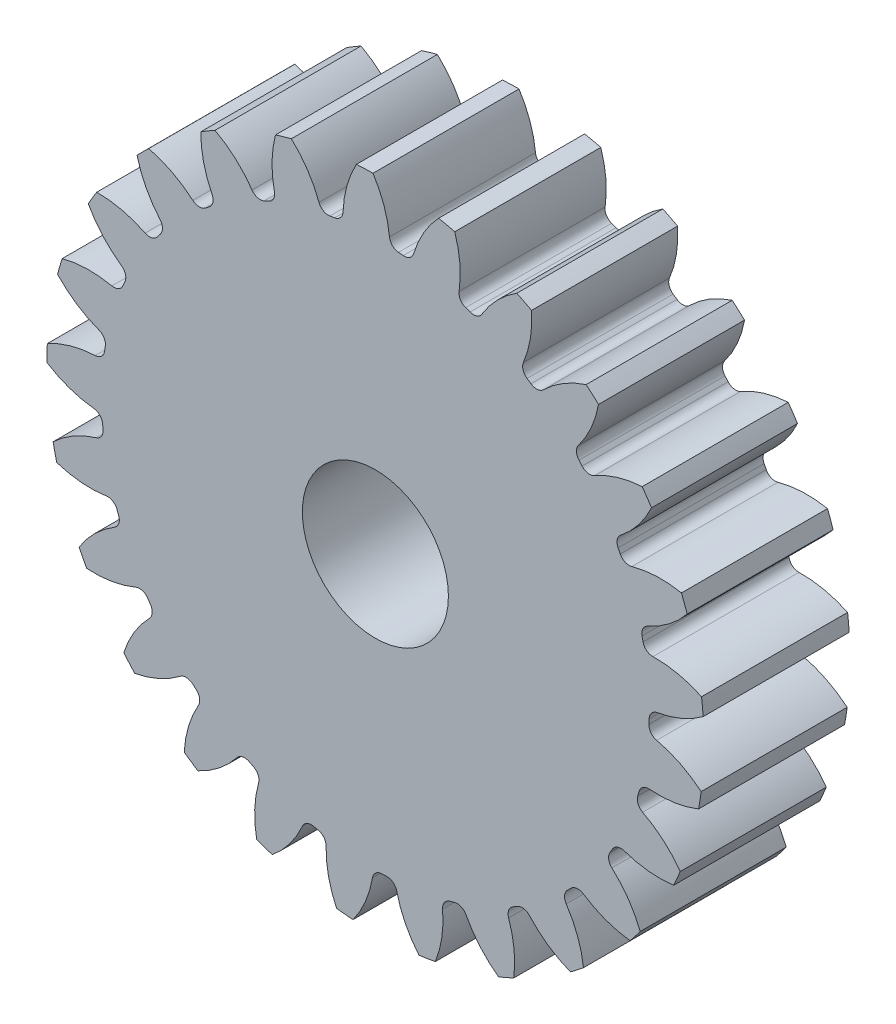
from build123d import *

# Parameters (mm, degrees)
SKETCH3_R         = 228.6
GEARBODY_DEPTH    = 101.6
TOOTHCUT_DEPTH    = 339.878267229
CIRPATTERN1_COUNT = 25
BOREDIA_R         = 50.8
BORE_DEPTH        = 12700


with BuildPart() as part:
    # Sketch3 → gearBody (new body)
    with BuildSketch(Plane.XY):
        Circle(SKETCH3_R)
    extrude(amount=GEARBODY_DEPTH)

    # Sketch2 → toothCut (cut, through all)
    with BuildSketch(Plane.XY):
        with BuildLine():
            ThreePointArc((190.355338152, -7.422616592), (190.412345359, -5.778298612), (190.455148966, -4.133549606))
            ThreePointArc((190.455148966, -4.133549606), (192.13037594, 0.222617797), (196.197218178, 2.51245929))
            ThreePointArc((196.197218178, 2.51245929), (213.232745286, 7.53346137), (228.6, 16.436670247))
            ThreePointArc((228.6, 16.436670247), (229.084691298, -6.951858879), (227.182690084, -30.267960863))
            ThreePointArc((227.182690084, -30.267960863), (212.383573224, -20.449316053), (195.683849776, -14.404575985))
            ThreePointArc((195.683849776, -14.404575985), (191.763339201, -11.87234837), (190.355338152, -7.422616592))
        make_face()
    toothcut = extrude(amount=TOOTHCUT_DEPTH, mode=Mode.SUBTRACT)

    # CirPattern1: toothCut ×25 about axis
    cirpattern1_axis = Axis((0, 0, 0), (0, 0, 1))
    for i in range(1, CIRPATTERN1_COUNT):
        add(toothcut.rotate(cirpattern1_axis, i * 360 / CIRPATTERN1_COUNT), mode=Mode.SUBTRACT)

    # boreDia → bore (cut, symmetric)
    with BuildSketch(Plane.XY):
        Circle(BOREDIA_R)
    extrude(amount=BORE_DEPTH, both=True, mode=Mode.SUBTRACT)


solid = part.part
